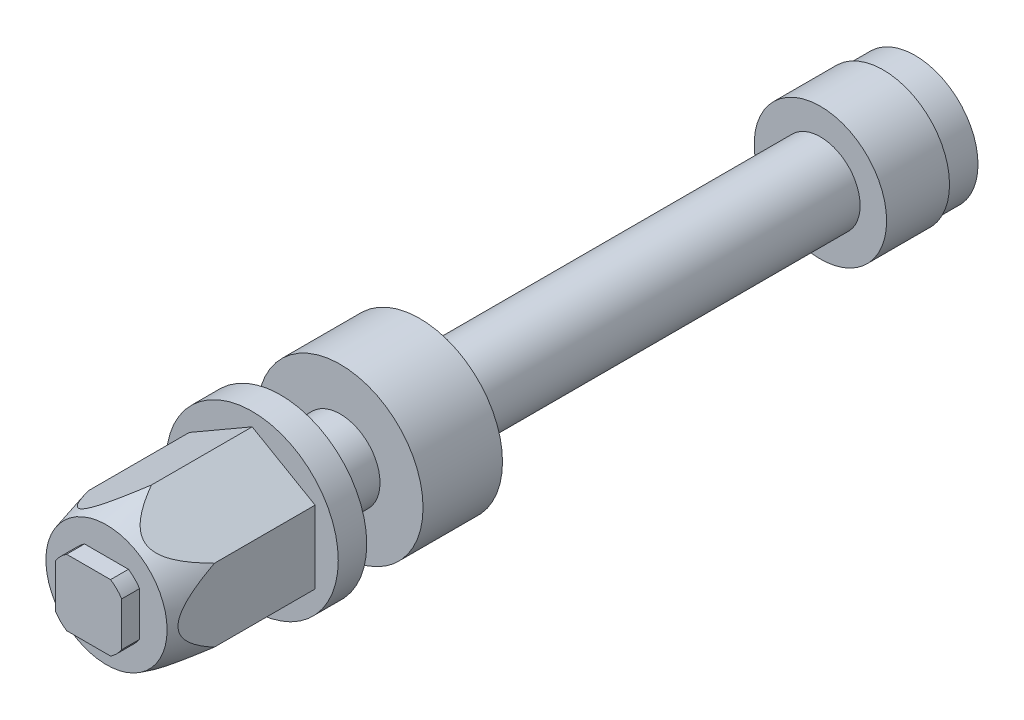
ISO-10303-21;
HEADER;
FILE_DESCRIPTION(('STEP AP214'),'2;1');
FILE_NAME('part.step','',(''),(''),'','','');
FILE_SCHEMA(('AUTOMOTIVE_DESIGN { 1 0 10303 214 1 1 1 1 }'));
ENDSEC;
DATA;
#1=APPLICATION_CONTEXT('core data for automotive mechanical design processes');
#2=APPLICATION_PROTOCOL_DEFINITION('international standard','automotive_design',2000,#1);
#3=PRODUCT_CONTEXT('',#1,'mechanical');
#4=PRODUCT('Part','Part','',(#3));
#5=PRODUCT_RELATED_PRODUCT_CATEGORY('part','',(#4));
#6=PRODUCT_DEFINITION_FORMATION('','',#4);
#7=PRODUCT_DEFINITION_CONTEXT('part definition',#1,'design');
#8=PRODUCT_DEFINITION('design','',#6,#7);
#9=PRODUCT_DEFINITION_SHAPE('','',#8);
#10=(LENGTH_UNIT() NAMED_UNIT(*) SI_UNIT(.MILLI.,.METRE.));
#11=(NAMED_UNIT(*) PLANE_ANGLE_UNIT() SI_UNIT($,.RADIAN.));
#12=(NAMED_UNIT(*) SI_UNIT($,.STERADIAN.) SOLID_ANGLE_UNIT());
#13=UNCERTAINTY_MEASURE_WITH_UNIT(LENGTH_MEASURE(1.E-05),#10,'distance_accuracy_value','');
#14=(GEOMETRIC_REPRESENTATION_CONTEXT(3) GLOBAL_UNCERTAINTY_ASSIGNED_CONTEXT((#13)) GLOBAL_UNIT_ASSIGNED_CONTEXT((#10,
#11,#12)) REPRESENTATION_CONTEXT('',''));
#15=CARTESIAN_POINT('',(0.,0.,0.));
#16=DIRECTION('',(0.,0.,1.));
#17=DIRECTION('',(1.,0.,0.));
#18=AXIS2_PLACEMENT_3D('',#15,#16,#17);
#19=CARTESIAN_POINT('',(-6.072,6.072,-98.));
#20=DIRECTION('',(0.,0.,-1.));
#21=DIRECTION('',(1.,0.,0.));
#22=AXIS2_PLACEMENT_3D('',#19,#20,#21);
#23=PLANE('',#22);
#24=CARTESIAN_POINT('',(0.,0.,-98.));
#25=DIRECTION('',(0.,0.,-1.));
#26=DIRECTION('',(1.,0.,0.));
#27=AXIS2_PLACEMENT_3D('',#24,#25,#26);
#28=CIRCLE('',#27,6.);
#29=CARTESIAN_POINT('',(6.,0.,-98.));
#30=VERTEX_POINT('',#29);
#31=EDGE_CURVE('E18',#30,#30,#28,.T.);
#32=ORIENTED_EDGE('',*,*,#31,.T.);
#33=EDGE_LOOP('',(#32));
#34=FACE_BOUND('',#33,.T.);
#35=ADVANCED_FACE('F14',(#34),#23,.T.);
#36=CARTESIAN_POINT('',(0.,0.,-95.8));
#37=DIRECTION('',(0.,0.,-1.));
#38=DIRECTION('',(1.,0.,0.));
#39=AXIS2_PLACEMENT_3D('',#36,#37,#38);
#40=CYLINDRICAL_SURFACE('',#39,6.);
#41=ORIENTED_EDGE('',*,*,#31,.F.);
#42=EDGE_LOOP('',(#41));
#43=FACE_BOUND('',#42,.T.);
#44=CARTESIAN_POINT('',(0.,0.,-95.8));
#45=DIRECTION('',(0.,0.,-1.));
#46=DIRECTION('',(1.,0.,0.));
#47=AXIS2_PLACEMENT_3D('',#44,#45,#46);
#48=CIRCLE('',#47,6.);
#49=CARTESIAN_POINT('',(6.,0.,-95.8));
#50=VERTEX_POINT('',#49);
#51=EDGE_CURVE('E337',#50,#50,#48,.F.);
#52=ORIENTED_EDGE('',*,*,#51,.F.);
#53=EDGE_LOOP('',(#52));
#54=FACE_BOUND('',#53,.T.);
#55=ADVANCED_FACE('F215',(#43,#54),#40,.T.);
#56=CARTESIAN_POINT('',(-9.614,9.614,-95.8));
#57=DIRECTION('',(0.,0.,-1.));
#58=DIRECTION('',(1.,0.,0.));
#59=AXIS2_PLACEMENT_3D('',#56,#57,#58);
#60=PLANE('',#59);
#61=ORIENTED_EDGE('',*,*,#51,.T.);
#62=EDGE_LOOP('',(#61));
#63=FACE_BOUND('',#62,.T.);
#64=CARTESIAN_POINT('',(0.,0.,-95.8));
#65=DIRECTION('',(0.,0.,-1.));
#66=DIRECTION('',(1.,0.,0.));
#67=AXIS2_PLACEMENT_3D('',#64,#65,#66);
#68=CIRCLE('',#67,9.5);
#69=CARTESIAN_POINT('',(9.5,0.,-95.8));
#70=VERTEX_POINT('',#69);
#71=EDGE_CURVE('E335',#70,#70,#68,.T.);
#72=ORIENTED_EDGE('',*,*,#71,.T.);
#73=EDGE_LOOP('',(#72));
#74=FACE_BOUND('',#73,.T.);
#75=ADVANCED_FACE('F217',(#63,#74),#60,.T.);
#76=CARTESIAN_POINT('',(0.,0.,-91.));
#77=DIRECTION('',(0.,0.,-1.));
#78=DIRECTION('',(1.,0.,0.));
#79=AXIS2_PLACEMENT_3D('',#76,#77,#78);
#80=CYLINDRICAL_SURFACE('',#79,9.5);
#81=ORIENTED_EDGE('',*,*,#71,.F.);
#82=EDGE_LOOP('',(#81));
#83=FACE_BOUND('',#82,.T.);
#84=CARTESIAN_POINT('',(0.,0.,-91.));
#85=DIRECTION('',(0.,0.,-1.));
#86=DIRECTION('',(1.,0.,0.));
#87=AXIS2_PLACEMENT_3D('',#84,#85,#86);
#88=CIRCLE('',#87,9.5);
#89=CARTESIAN_POINT('',(9.5,0.,-91.));
#90=VERTEX_POINT('',#89);
#91=EDGE_CURVE('E332',#90,#90,#88,.F.);
#92=ORIENTED_EDGE('',*,*,#91,.F.);
#93=EDGE_LOOP('',(#92));
#94=FACE_BOUND('',#93,.T.);
#95=ADVANCED_FACE('F220',(#83,#94),#80,.T.);
#96=CARTESIAN_POINT('',(-10.12,10.12,-91.));
#97=DIRECTION('',(0.,0.,-1.));
#98=DIRECTION('',(1.,0.,0.));
#99=AXIS2_PLACEMENT_3D('',#96,#97,#98);
#100=PLANE('',#99);
#101=ORIENTED_EDGE('',*,*,#91,.T.);
#102=EDGE_LOOP('',(#101));
#103=FACE_BOUND('',#102,.T.);
#104=CARTESIAN_POINT('',(0.,0.,-91.));
#105=DIRECTION('',(0.,0.,-1.));
#106=DIRECTION('',(1.,0.,0.));
#107=AXIS2_PLACEMENT_3D('',#104,#105,#106);
#108=CIRCLE('',#107,10.);
#109=CARTESIAN_POINT('',(10.,0.,-91.));
#110=VERTEX_POINT('',#109);
#111=EDGE_CURVE('E329',#110,#110,#108,.T.);
#112=ORIENTED_EDGE('',*,*,#111,.T.);
#113=EDGE_LOOP('',(#112));
#114=FACE_BOUND('',#113,.T.);
#115=ADVANCED_FACE('F222',(#103,#114),#100,.T.);
#116=CARTESIAN_POINT('',(0.,0.,-81.5));
#117=DIRECTION('',(0.,0.,-1.));
#118=DIRECTION('',(1.,0.,0.));
#119=AXIS2_PLACEMENT_3D('',#116,#117,#118);
#120=CYLINDRICAL_SURFACE('',#119,10.);
#121=ORIENTED_EDGE('',*,*,#111,.F.);
#122=EDGE_LOOP('',(#121));
#123=FACE_BOUND('',#122,.T.);
#124=CARTESIAN_POINT('',(0.,0.,-81.5));
#125=DIRECTION('',(0.,0.,-1.));
#126=DIRECTION('',(1.,0.,0.));
#127=AXIS2_PLACEMENT_3D('',#124,#125,#126);
#128=CIRCLE('',#127,10.);
#129=CARTESIAN_POINT('',(10.,0.,-81.5));
#130=VERTEX_POINT('',#129);
#131=EDGE_CURVE('E326',#130,#130,#128,.F.);
#132=ORIENTED_EDGE('',*,*,#131,.F.);
#133=EDGE_LOOP('',(#132));
#134=FACE_BOUND('',#133,.T.);
#135=ADVANCED_FACE('F225',(#123,#134),#120,.T.);
#136=CARTESIAN_POINT('',(10.12,10.12,-81.5));
#137=DIRECTION('',(0.,0.,1.));
#138=DIRECTION('',(-1.,0.,0.));
#139=AXIS2_PLACEMENT_3D('',#136,#137,#138);
#140=PLANE('',#139);
#141=CARTESIAN_POINT('',(0.,0.,-81.5));
#142=DIRECTION('',(0.,0.,-1.));
#143=DIRECTION('',(1.,0.,0.));
#144=AXIS2_PLACEMENT_3D('',#141,#142,#143);
#145=CIRCLE('',#144,6.);
#146=CARTESIAN_POINT('',(6.,0.,-81.5));
#147=VERTEX_POINT('',#146);
#148=EDGE_CURVE('E323',#147,#147,#145,.T.);
#149=ORIENTED_EDGE('',*,*,#148,.T.);
#150=EDGE_LOOP('',(#149));
#151=FACE_BOUND('',#150,.T.);
#152=ORIENTED_EDGE('',*,*,#131,.T.);
#153=EDGE_LOOP('',(#152));
#154=FACE_BOUND('',#153,.T.);
#155=ADVANCED_FACE('F227',(#151,#154),#140,.T.);
#156=CARTESIAN_POINT('',(0.,0.,-21.));
#157=DIRECTION('',(0.,0.,-1.));
#158=DIRECTION('',(1.,0.,0.));
#159=AXIS2_PLACEMENT_3D('',#156,#157,#158);
#160=CYLINDRICAL_SURFACE('',#159,6.);
#161=ORIENTED_EDGE('',*,*,#148,.F.);
#162=EDGE_LOOP('',(#161));
#163=FACE_BOUND('',#162,.T.);
#164=CARTESIAN_POINT('',(0.,0.,-21.));
#165=DIRECTION('',(0.,0.,-1.));
#166=DIRECTION('',(1.,0.,0.));
#167=AXIS2_PLACEMENT_3D('',#164,#165,#166);
#168=CIRCLE('',#167,6.);
#169=CARTESIAN_POINT('',(6.,0.,-21.));
#170=VERTEX_POINT('',#169);
#171=EDGE_CURVE('E320',#170,#170,#168,.F.);
#172=ORIENTED_EDGE('',*,*,#171,.F.);
#173=EDGE_LOOP('',(#172));
#174=FACE_BOUND('',#173,.T.);
#175=ADVANCED_FACE('F230',(#163,#174),#160,.T.);
#176=CARTESIAN_POINT('',(5.,5.,29.));
#177=DIRECTION('',(0.,0.,1.));
#178=DIRECTION('',(-1.,0.,0.));
#179=AXIS2_PLACEMENT_3D('',#176,#177,#178);
#180=PLANE('',#179);
#181=CARTESIAN_POINT('',(0.,0.,29.));
#182=DIRECTION('',(0.,0.,-1.));
#183=DIRECTION('',(1.,0.,0.));
#184=AXIS2_PLACEMENT_3D('',#181,#182,#183);
#185=CIRCLE('',#184,6.);
#186=CARTESIAN_POINT('',(-3.31662479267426,4.99999999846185,29.));
#187=VERTEX_POINT('',#186);
#188=CARTESIAN_POINT('',(-5.,3.3166247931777,29.));
#189=VERTEX_POINT('',#188);
#190=EDGE_CURVE('E116',#187,#189,#185,.F.);
#191=ORIENTED_EDGE('',*,*,#190,.T.);
#192=DIRECTION('',(0.,-1.,0.));
#193=VECTOR('',#192,1.);
#194=CARTESIAN_POINT('',(-5.,-5.00004168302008E-10,29.));
#195=LINE('',#194,#193);
#196=CARTESIAN_POINT('',(-4.99999999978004,-3.31662479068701,29.));
#197=VERTEX_POINT('',#196);
#198=EDGE_CURVE('E120',#189,#197,#195,.T.);
#199=ORIENTED_EDGE('',*,*,#198,.T.);
#200=CARTESIAN_POINT('',(0.,0.,29.));
#201=DIRECTION('',(0.,0.,-1.));
#202=DIRECTION('',(1.,0.,0.));
#203=AXIS2_PLACEMENT_3D('',#200,#201,#202);
#204=CIRCLE('',#203,6.);
#205=CARTESIAN_POINT('',(-3.31662479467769,-5.,29.));
#206=VERTEX_POINT('',#205);
#207=EDGE_CURVE('E139',#197,#206,#204,.F.);
#208=ORIENTED_EDGE('',*,*,#207,.T.);
#209=DIRECTION('',(1.,0.,0.));
#210=VECTOR('',#209,1.);
#211=CARTESIAN_POINT('',(-9.99995825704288E-10,-5.,29.));
#212=LINE('',#211,#210);
#213=CARTESIAN_POINT('',(3.31662479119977,-4.99999999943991,29.));
#214=VERTEX_POINT('',#213);
#215=EDGE_CURVE('E142',#206,#214,#212,.T.);
#216=ORIENTED_EDGE('',*,*,#215,.T.);
#217=CARTESIAN_POINT('',(0.,0.,29.));
#218=DIRECTION('',(0.,0.,-1.));
#219=DIRECTION('',(1.,0.,0.));
#220=AXIS2_PLACEMENT_3D('',#217,#218,#219);
#221=CIRCLE('',#220,6.);
#222=CARTESIAN_POINT('',(5.,-3.31662479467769,29.));
#223=VERTEX_POINT('',#222);
#224=EDGE_CURVE('E314',#214,#223,#221,.F.);
#225=ORIENTED_EDGE('',*,*,#224,.T.);
#226=DIRECTION('',(0.,1.,0.));
#227=VECTOR('',#226,1.);
#228=CARTESIAN_POINT('',(5.,-1.49999604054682E-09,29.));
#229=LINE('',#228,#227);
#230=CARTESIAN_POINT('',(5.00000000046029,3.3166247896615,29.));
#231=VERTEX_POINT('',#230);
#232=EDGE_CURVE('E592',#223,#231,#229,.T.);
#233=ORIENTED_EDGE('',*,*,#232,.T.);
#234=CARTESIAN_POINT('',(0.,0.,29.));
#235=DIRECTION('',(0.,0.,-1.));
#236=DIRECTION('',(1.,0.,0.));
#237=AXIS2_PLACEMENT_3D('',#234,#235,#236);
#238=CIRCLE('',#237,6.);
#239=CARTESIAN_POINT('',(3.3166247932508,4.99999999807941,29.));
#240=VERTEX_POINT('',#239);
#241=EDGE_CURVE('E311',#231,#240,#238,.F.);
#242=ORIENTED_EDGE('',*,*,#241,.T.);
#243=DIRECTION('',(-1.,0.,0.));
#244=VECTOR('',#243,1.);
#245=CARTESIAN_POINT('',(0.,5.,29.));
#246=LINE('',#245,#244);
#247=EDGE_CURVE('E113',#240,#187,#246,.T.);
#248=ORIENTED_EDGE('',*,*,#247,.T.);
#249=EDGE_LOOP('',(#191,#199,#208,#216,#225,#233,#242,#248));
#250=FACE_BOUND('',#249,.T.);
#251=ADVANCED_FACE('F118',(#250),#180,.T.);
#252=CARTESIAN_POINT('',(-12.65,12.65,-21.));
#253=DIRECTION('',(0.,0.,-1.));
#254=DIRECTION('',(1.,0.,0.));
#255=AXIS2_PLACEMENT_3D('',#252,#253,#254);
#256=PLANE('',#255);
#257=ORIENTED_EDGE('',*,*,#171,.T.);
#258=EDGE_LOOP('',(#257));
#259=FACE_BOUND('',#258,.T.);
#260=CARTESIAN_POINT('',(0.,0.,-21.));
#261=DIRECTION('',(0.,0.,-1.));
#262=DIRECTION('',(1.,0.,0.));
#263=AXIS2_PLACEMENT_3D('',#260,#261,#262);
#264=CIRCLE('',#263,12.5);
#265=CARTESIAN_POINT('',(12.5,0.,-21.));
#266=VERTEX_POINT('',#265);
#267=EDGE_CURVE('E307',#266,#266,#264,.T.);
#268=ORIENTED_EDGE('',*,*,#267,.T.);
#269=EDGE_LOOP('',(#268));
#270=FACE_BOUND('',#269,.T.);
#271=ADVANCED_FACE('F234',(#259,#270),#256,.T.);
#272=CARTESIAN_POINT('',(-3.31662479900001,5.,26.3));
#273=DIRECTION('',(0.,-1.,0.));
#274=DIRECTION('',(1.,0.,0.));
#275=AXIS2_PLACEMENT_3D('',#272,#273,#274);
#276=PLANE('',#275);
#277=DIRECTION('',(0.,0.,1.));
#278=VECTOR('',#277,1.);
#279=CARTESIAN_POINT('',(3.31662479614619,4.99999999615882,27.65));
#280=LINE('',#279,#278);
#281=CARTESIAN_POINT('',(3.31662479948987,4.99999999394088,26.3));
#282=VERTEX_POINT('',#281);
#283=EDGE_CURVE('E310',#240,#282,#280,.F.);
#284=ORIENTED_EDGE('',*,*,#283,.T.);
#285=DIRECTION('',(-1.,0.,0.));
#286=VECTOR('',#285,1.);
#287=CARTESIAN_POINT('',(0.,4.99999999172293,26.3));
#288=LINE('',#287,#286);
#289=CARTESIAN_POINT('',(-3.31662479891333,4.99999999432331,26.3));
#290=VERTEX_POINT('',#289);
#291=EDGE_CURVE('E306',#282,#290,#288,.T.);
#292=ORIENTED_EDGE('',*,*,#291,.T.);
#293=DIRECTION('',(0.,0.,-1.));
#294=VECTOR('',#293,1.);
#295=CARTESIAN_POINT('',(-3.3166247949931,4.9999999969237,27.65));
#296=LINE('',#295,#294);
#297=EDGE_CURVE('E125',#290,#187,#296,.F.);
#298=ORIENTED_EDGE('',*,*,#297,.T.);
#299=ORIENTED_EDGE('',*,*,#247,.F.);
#300=EDGE_LOOP('',(#284,#292,#298,#299));
#301=FACE_BOUND('',#300,.T.);
#302=ADVANCED_FACE('F237',(#301),#276,.F.);
#303=CARTESIAN_POINT('',(0.,0.,29.));
#304=DIRECTION('',(0.,0.,-1.));
#305=DIRECTION('',(1.,0.,0.));
#306=AXIS2_PLACEMENT_3D('',#303,#304,#305);
#307=CYLINDRICAL_SURFACE('',#306,6.);
#308=ORIENTED_EDGE('',*,*,#190,.F.);
#309=ORIENTED_EDGE('',*,*,#297,.F.);
#310=CARTESIAN_POINT('',(0.,0.,26.3));
#311=DIRECTION('',(0.,0.,-1.));
#312=DIRECTION('',(1.,0.,0.));
#313=AXIS2_PLACEMENT_3D('',#310,#311,#312);
#314=CIRCLE('',#313,6.);
#315=CARTESIAN_POINT('',(-4.99999999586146,3.31662479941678,26.3));
#316=VERTEX_POINT('',#315);
#317=EDGE_CURVE('E130',#290,#316,#314,.F.);
#318=ORIENTED_EDGE('',*,*,#317,.T.);
#319=DIRECTION('',(0.,0.,1.));
#320=VECTOR('',#319,1.);
#321=CARTESIAN_POINT('',(-5.,3.316624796,27.65));
#322=LINE('',#321,#320);
#323=EDGE_CURVE('E124',#316,#189,#322,.T.);
#324=ORIENTED_EDGE('',*,*,#323,.T.);
#325=EDGE_LOOP('',(#308,#309,#318,#324));
#326=FACE_BOUND('',#325,.T.);
#327=ADVANCED_FACE('F128',(#326),#307,.T.);
#328=CARTESIAN_POINT('',(-5.,-3.31662479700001,26.3));
#329=DIRECTION('',(1.,0.,0.));
#330=DIRECTION('',(0.,1.,0.));
#331=AXIS2_PLACEMENT_3D('',#328,#329,#330);
#332=PLANE('',#331);
#333=ORIENTED_EDGE('',*,*,#323,.F.);
#334=DIRECTION('',(0.,-1.,0.));
#335=VECTOR('',#334,1.);
#336=CARTESIAN_POINT('',(-4.99999999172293,0.,26.3));
#337=LINE('',#336,#335);
#338=CARTESIAN_POINT('',(-4.9999999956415,-3.31662479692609,26.3));
#339=VERTEX_POINT('',#338);
#340=EDGE_CURVE('E304',#316,#339,#337,.T.);
#341=ORIENTED_EDGE('',*,*,#340,.T.);
#342=DIRECTION('',(0.,0.,-1.));
#343=VECTOR('',#342,1.);
#344=CARTESIAN_POINT('',(-4.99999999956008,-3.31662479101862,27.65));
#345=LINE('',#344,#343);
#346=EDGE_CURVE('E136',#339,#197,#345,.F.);
#347=ORIENTED_EDGE('',*,*,#346,.T.);
#348=ORIENTED_EDGE('',*,*,#198,.F.);
#349=EDGE_LOOP('',(#333,#341,#347,#348));
#350=FACE_BOUND('',#349,.T.);
#351=ADVANCED_FACE('F134',(#350),#332,.F.);
#352=CARTESIAN_POINT('',(0.,0.,29.));
#353=DIRECTION('',(0.,0.,-1.));
#354=DIRECTION('',(1.,0.,0.));
#355=AXIS2_PLACEMENT_3D('',#352,#353,#354);
#356=CYLINDRICAL_SURFACE('',#355,6.);
#357=ORIENTED_EDGE('',*,*,#207,.F.);
#358=ORIENTED_EDGE('',*,*,#346,.F.);
#359=CARTESIAN_POINT('',(0.,0.,26.3));
#360=DIRECTION('',(0.,0.,-1.));
#361=DIRECTION('',(1.,0.,0.));
#362=AXIS2_PLACEMENT_3D('',#359,#360,#361);
#363=CIRCLE('',#362,6.);
#364=CARTESIAN_POINT('',(-3.31662480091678,-4.99999999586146,26.3));
#365=VERTEX_POINT('',#364);
#366=EDGE_CURVE('E302',#339,#365,#363,.F.);
#367=ORIENTED_EDGE('',*,*,#366,.T.);
#368=DIRECTION('',(0.,0.,1.));
#369=VECTOR('',#368,1.);
#370=CARTESIAN_POINT('',(-3.316624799,-5.,27.65));
#371=LINE('',#370,#369);
#372=EDGE_CURVE('E318',#365,#206,#371,.T.);
#373=ORIENTED_EDGE('',*,*,#372,.T.);
#374=EDGE_LOOP('',(#357,#358,#367,#373));
#375=FACE_BOUND('',#374,.T.);
#376=ADVANCED_FACE('F244',(#375),#356,.T.);
#377=CARTESIAN_POINT('',(3.31662479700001,-5.,26.3));
#378=DIRECTION('',(0.,1.,0.));
#379=DIRECTION('',(-1.,0.,0.));
#380=AXIS2_PLACEMENT_3D('',#377,#378,#379);
#381=PLANE('',#380);
#382=ORIENTED_EDGE('',*,*,#372,.F.);
#383=DIRECTION('',(1.,0.,0.));
#384=VECTOR('',#383,1.);
#385=CARTESIAN_POINT('',(0.,-4.99999999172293,26.3));
#386=LINE('',#385,#384);
#387=CARTESIAN_POINT('',(3.31662479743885,-4.99999999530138,26.3));
#388=VERTEX_POINT('',#387);
#389=EDGE_CURVE('E301',#365,#388,#386,.T.);
#390=ORIENTED_EDGE('',*,*,#389,.T.);
#391=DIRECTION('',(0.,0.,-1.));
#392=VECTOR('',#391,1.);
#393=CARTESIAN_POINT('',(3.31662479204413,-4.99999999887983,27.65));
#394=LINE('',#393,#392);
#395=EDGE_CURVE('E317',#388,#214,#394,.F.);
#396=ORIENTED_EDGE('',*,*,#395,.T.);
#397=ORIENTED_EDGE('',*,*,#215,.F.);
#398=EDGE_LOOP('',(#382,#390,#396,#397));
#399=FACE_BOUND('',#398,.T.);
#400=ADVANCED_FACE('F245',(#399),#381,.F.);
#401=CARTESIAN_POINT('',(0.,0.,29.));
#402=DIRECTION('',(0.,0.,-1.));
#403=DIRECTION('',(1.,0.,0.));
#404=AXIS2_PLACEMENT_3D('',#401,#402,#403);
#405=CYLINDRICAL_SURFACE('',#404,6.);
#406=ORIENTED_EDGE('',*,*,#224,.F.);
#407=ORIENTED_EDGE('',*,*,#395,.F.);
#408=CARTESIAN_POINT('',(0.,0.,26.3));
#409=DIRECTION('',(0.,0.,-1.));
#410=DIRECTION('',(1.,0.,0.));
#411=AXIS2_PLACEMENT_3D('',#408,#409,#410);
#412=CIRCLE('',#411,6.);
#413=CARTESIAN_POINT('',(4.99999999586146,-3.31662480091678,26.3));
#414=VERTEX_POINT('',#413);
#415=EDGE_CURVE('E299',#388,#414,#412,.F.);
#416=ORIENTED_EDGE('',*,*,#415,.T.);
#417=DIRECTION('',(0.,0.,1.));
#418=VECTOR('',#417,1.);
#419=CARTESIAN_POINT('',(5.,-3.316624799,27.65));
#420=LINE('',#419,#418);
#421=EDGE_CURVE('E316',#414,#223,#420,.T.);
#422=ORIENTED_EDGE('',*,*,#421,.T.);
#423=EDGE_LOOP('',(#406,#407,#416,#422));
#424=FACE_BOUND('',#423,.T.);
#425=ADVANCED_FACE('F248',(#424),#405,.T.);
#426=CARTESIAN_POINT('',(5.,3.31662479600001,26.3));
#427=DIRECTION('',(-1.,0.,0.));
#428=DIRECTION('',(0.,-1.,0.));
#429=AXIS2_PLACEMENT_3D('',#426,#427,#428);
#430=PLANE('',#429);
#431=ORIENTED_EDGE('',*,*,#421,.F.);
#432=DIRECTION('',(0.,1.,0.));
#433=VECTOR('',#432,1.);
#434=CARTESIAN_POINT('',(4.99999999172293,0.,26.3));
#435=LINE('',#434,#433);
#436=CARTESIAN_POINT('',(4.99999999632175,3.31662479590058,26.3));
#437=VERTEX_POINT('',#436);
#438=EDGE_CURVE('E298',#414,#437,#435,.T.);
#439=ORIENTED_EDGE('',*,*,#438,.T.);
#440=DIRECTION('',(0.,0.,-1.));
#441=VECTOR('',#440,1.);
#442=CARTESIAN_POINT('',(5.00000000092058,3.31662478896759,27.65));
#443=LINE('',#442,#441);
#444=EDGE_CURVE('E313',#437,#231,#443,.F.);
#445=ORIENTED_EDGE('',*,*,#444,.T.);
#446=ORIENTED_EDGE('',*,*,#232,.F.);
#447=EDGE_LOOP('',(#431,#439,#445,#446));
#448=FACE_BOUND('',#447,.T.);
#449=ADVANCED_FACE('F250',(#448),#430,.F.);
#450=CARTESIAN_POINT('',(0.,0.,29.));
#451=DIRECTION('',(0.,0.,-1.));
#452=DIRECTION('',(1.,0.,0.));
#453=AXIS2_PLACEMENT_3D('',#450,#451,#452);
#454=CYLINDRICAL_SURFACE('',#453,6.);
#455=ORIENTED_EDGE('',*,*,#241,.F.);
#456=ORIENTED_EDGE('',*,*,#444,.F.);
#457=CARTESIAN_POINT('',(0.,0.,26.3));
#458=DIRECTION('',(0.,0.,-1.));
#459=DIRECTION('',(1.,0.,0.));
#460=AXIS2_PLACEMENT_3D('',#457,#458,#459);
#461=CIRCLE('',#460,6.);
#462=EDGE_CURVE('E295',#437,#282,#461,.F.);
#463=ORIENTED_EDGE('',*,*,#462,.T.);
#464=ORIENTED_EDGE('',*,*,#283,.F.);
#465=EDGE_LOOP('',(#455,#456,#463,#464));
#466=FACE_BOUND('',#465,.T.);
#467=ADVANCED_FACE('F253',(#466),#454,.T.);
#468=CARTESIAN_POINT('',(0.,0.,-9.));
#469=DIRECTION('',(0.,0.,-1.));
#470=DIRECTION('',(1.,0.,0.));
#471=AXIS2_PLACEMENT_3D('',#468,#469,#470);
#472=CYLINDRICAL_SURFACE('',#471,12.5);
#473=ORIENTED_EDGE('',*,*,#267,.F.);
#474=EDGE_LOOP('',(#473));
#475=FACE_BOUND('',#474,.T.);
#476=CARTESIAN_POINT('',(0.,0.,-9.));
#477=DIRECTION('',(0.,0.,-1.));
#478=DIRECTION('',(1.,0.,0.));
#479=AXIS2_PLACEMENT_3D('',#476,#477,#478);
#480=CIRCLE('',#479,12.5);
#481=CARTESIAN_POINT('',(12.5,0.,-9.));
#482=VERTEX_POINT('',#481);
#483=EDGE_CURVE('E292',#482,#482,#480,.F.);
#484=ORIENTED_EDGE('',*,*,#483,.F.);
#485=EDGE_LOOP('',(#484));
#486=FACE_BOUND('',#485,.T.);
#487=ADVANCED_FACE('F259',(#475,#486),#472,.T.);
#488=CARTESIAN_POINT('',(9.26080236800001,-9.26080236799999,26.3));
#489=DIRECTION('',(0.,0.,-1.));
#490=DIRECTION('',(-1.,0.,0.));
#491=AXIS2_PLACEMENT_3D('',#488,#489,#490);
#492=PLANE('',#491);
#493=ORIENTED_EDGE('',*,*,#438,.F.);
#494=ORIENTED_EDGE('',*,*,#415,.F.);
#495=ORIENTED_EDGE('',*,*,#389,.F.);
#496=ORIENTED_EDGE('',*,*,#366,.F.);
#497=ORIENTED_EDGE('',*,*,#340,.F.);
#498=ORIENTED_EDGE('',*,*,#317,.F.);
#499=ORIENTED_EDGE('',*,*,#291,.F.);
#500=ORIENTED_EDGE('',*,*,#462,.F.);
#501=EDGE_LOOP('',(#493,#494,#495,#496,#497,#498,#499,#500));
#502=FACE_BOUND('',#501,.T.);
#503=CARTESIAN_POINT('',(0.,0.,26.3));
#504=DIRECTION('',(0.,0.,-1.));
#505=DIRECTION('',(1.,0.,0.));
#506=AXIS2_PLACEMENT_3D('',#503,#504,#505);
#507=CIRCLE('',#506,9.150990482);
#508=CARTESIAN_POINT('',(9.150990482,0.,26.3));
#509=VERTEX_POINT('',#508);
#510=EDGE_CURVE('E289',#509,#509,#507,.F.);
#511=ORIENTED_EDGE('',*,*,#510,.T.);
#512=EDGE_LOOP('',(#511));
#513=FACE_BOUND('',#512,.T.);
#514=ADVANCED_FACE('F255',(#502,#513),#492,.F.);
#515=CARTESIAN_POINT('',(12.65,12.65,-9.));
#516=DIRECTION('',(0.,0.,1.));
#517=DIRECTION('',(-1.,0.,0.));
#518=AXIS2_PLACEMENT_3D('',#515,#516,#517);
#519=PLANE('',#518);
#520=CARTESIAN_POINT('',(0.,0.,-9.));
#521=DIRECTION('',(0.,0.,-1.));
#522=DIRECTION('',(1.,0.,0.));
#523=AXIS2_PLACEMENT_3D('',#520,#521,#522);
#524=CIRCLE('',#523,6.);
#525=CARTESIAN_POINT('',(6.,0.,-9.));
#526=VERTEX_POINT('',#525);
#527=EDGE_CURVE('E281',#526,#526,#524,.T.);
#528=ORIENTED_EDGE('',*,*,#527,.T.);
#529=EDGE_LOOP('',(#528));
#530=FACE_BOUND('',#529,.T.);
#531=ORIENTED_EDGE('',*,*,#483,.T.);
#532=EDGE_LOOP('',(#531));
#533=FACE_BOUND('',#532,.T.);
#534=ADVANCED_FACE('F258',(#530,#533),#519,.T.);
#535=CARTESIAN_POINT('',(0.,0.,26.3));
#536=DIRECTION('',(0.,0.,-1.));
#537=DIRECTION('',(1.,0.,0.));
#538=AXIS2_PLACEMENT_3D('',#535,#536,#537);
#539=CONICAL_SURFACE('',#538,9.150990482,0.261799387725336);
#540=ORIENTED_EDGE('',*,*,#510,.F.);
#541=EDGE_LOOP('',(#540));
#542=FACE_BOUND('',#541,.T.);
#543=CARTESIAN_POINT('',(6.10256282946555E-09,-10.9696551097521,19.5126511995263));
#544=CARTESIAN_POINT('',(0.0634488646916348,-10.9330228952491,19.6493562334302));
#545=CARTESIAN_POINT('',(0.127631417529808,-10.8959670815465,19.78560607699));
#546=CARTESIAN_POINT('',(0.257633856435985,-10.8209101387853,20.0570747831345));
#547=CARTESIAN_POINT('',(0.32345388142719,-10.7829089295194,20.192293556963));
#548=CARTESIAN_POINT('',(0.523848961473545,-10.6672107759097,20.5966722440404));
#549=CARTESIAN_POINT('',(0.661131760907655,-10.587950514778,20.8640613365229));
#550=CARTESIAN_POINT('',(0.946289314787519,-10.4233147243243,21.3956178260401));
#551=CARTESIAN_POINT('',(1.09427022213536,-10.3378779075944,21.6597096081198));
#552=CARTESIAN_POINT('',(1.40172472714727,-10.1603689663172,22.178663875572));
#553=CARTESIAN_POINT('',(1.56118902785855,-10.0683022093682,22.4335335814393));
#554=CARTESIAN_POINT('',(1.80700454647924,-9.92638055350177,22.7987192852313));
#555=CARTESIAN_POINT('',(1.88749663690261,-9.87990842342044,22.9142972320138));
#556=CARTESIAN_POINT('',(2.0523607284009,-9.784724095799,23.1417441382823));
#557=CARTESIAN_POINT('',(2.13673317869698,-9.73601163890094,23.2536126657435));
#558=CARTESIAN_POINT('',(2.30985609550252,-9.63605907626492,23.4726406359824));
#559=CARTESIAN_POINT('',(2.39860372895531,-9.584820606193,23.5798030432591));
#560=CARTESIAN_POINT('',(2.58115638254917,-9.47942378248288,23.7881875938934));
#561=CARTESIAN_POINT('',(2.67496035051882,-9.42526603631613,23.8894109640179));
#562=CARTESIAN_POINT('',(2.9233183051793,-9.28187650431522,24.1396866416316));
#563=CARTESIAN_POINT('',(3.08212147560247,-9.19019145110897,24.2832583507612));
#564=CARTESIAN_POINT('',(3.41643833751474,-8.99717352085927,24.5416779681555));
#565=CARTESIAN_POINT('',(3.59190139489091,-8.89586987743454,24.6566092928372));
#566=CARTESIAN_POINT('',(3.89869957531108,-8.71873986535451,24.8120548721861));
#567=CARTESIAN_POINT('',(4.02538741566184,-8.64559660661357,24.8646084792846));
#568=CARTESIAN_POINT('',(4.28450978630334,-8.49599223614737,24.9451218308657));
#569=CARTESIAN_POINT('',(4.41693645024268,-8.41953566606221,24.9731141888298));
#570=CARTESIAN_POINT('',(4.68483156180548,-8.26486635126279,25.0010793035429));
#571=CARTESIAN_POINT('',(4.8203130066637,-8.18664610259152,25.0008921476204));
#572=CARTESIAN_POINT('',(5.08898080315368,-8.03153067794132,24.9721319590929));
#573=CARTESIAN_POINT('',(5.22216570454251,-7.95463633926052,24.9435416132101));
#574=CARTESIAN_POINT('',(5.5100403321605,-7.78843184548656,24.8529690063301));
#575=CARTESIAN_POINT('',(5.66333734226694,-7.69992577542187,24.7852134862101));
#576=CARTESIAN_POINT('',(5.95867005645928,-7.52941535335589,24.6225226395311));
#577=CARTESIAN_POINT('',(6.10067910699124,-7.44742638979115,24.5275252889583));
#578=CARTESIAN_POINT('',(6.35825831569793,-7.29871296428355,24.3300827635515));
#579=CARTESIAN_POINT('',(6.47501165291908,-7.23130539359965,24.2296450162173));
#580=CARTESIAN_POINT('',(6.7007215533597,-7.10099172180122,24.0175948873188));
#581=CARTESIAN_POINT('',(6.8096710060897,-7.0380897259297,23.9059725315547));
#582=CARTESIAN_POINT('',(7.02146523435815,-6.91581027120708,23.6736789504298));
#583=CARTESIAN_POINT('',(7.12426171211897,-6.85646069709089,23.5529496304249));
#584=CARTESIAN_POINT('',(7.32388119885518,-6.74121033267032,23.3052143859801));
#585=CARTESIAN_POINT('',(7.4207065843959,-6.6853081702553,23.1782109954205));
#586=CARTESIAN_POINT('',(7.6148771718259,-6.57320372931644,22.9116471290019));
#587=CARTESIAN_POINT('',(7.71191369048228,-6.51717966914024,22.771788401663));
#588=CARTESIAN_POINT('',(7.90115733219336,-6.40791980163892,22.4877653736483));
#589=CARTESIAN_POINT('',(7.99336354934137,-6.35468451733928,22.3436002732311));
#590=CARTESIAN_POINT('',(8.26401505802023,-6.19842379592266,21.9056561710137));
#591=CARTESIAN_POINT('',(8.43625499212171,-6.09898102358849,21.6067650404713));
#592=CARTESIAN_POINT('',(8.76209449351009,-5.91085749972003,21.0112743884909));
#593=CARTESIAN_POINT('',(8.91614852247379,-5.82191436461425,20.7150011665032));
#594=CARTESIAN_POINT('',(9.14015466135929,-5.69258436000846,20.2665652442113));
#595=CARTESIAN_POINT('',(9.2135296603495,-5.65022128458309,20.1166646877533));
#596=CARTESIAN_POINT('',(9.3582370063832,-5.56667445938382,19.8155785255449));
#597=CARTESIAN_POINT('',(9.42956961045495,-5.52549056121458,19.6643930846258));
#598=CARTESIAN_POINT('',(9.49999999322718,-5.48482756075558,19.5126512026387));
#599=B_SPLINE_CURVE_WITH_KNOTS('',3,(#543,#544,#545,#546,#547,#548,#549,#550,#551,#552,#553,
#554,#555,#556,#557,#558,#559,#560,#561,#562,#563,#564,#565,#566,#567,#568,#569,#570,#571,#572,
#573,#574,#575,#576,#577,#578,#579,#580,#581,#582,#583,#584,#585,#586,#587,#588,#589,#590,#591,
#592,#593,#594,#595,#596,#597,#598),.UNSPECIFIED.,.F.,.F.,(4,2,2,2,2,2,2,2,2,2,2,2,2,2,2,2,2,2,
2,2,2,2,2,2,2,2,2,4),(0.,0.465292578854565,0.930624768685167,1.86296450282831,2.80634177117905,
3.74896368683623,4.19381456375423,4.63871707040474,5.08333517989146,5.52786112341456,
6.22481389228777,6.91971238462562,7.38431302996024,7.8482958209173,8.3149117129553,
8.78181220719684,9.34723824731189,9.91396200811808,10.4175759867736,10.9216431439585,
11.4292537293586,11.9366609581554,12.4741121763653,13.0116638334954,14.0880685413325,
15.1245428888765,15.6410886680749,16.1575691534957),.UNSPECIFIED.);
#600=CARTESIAN_POINT('',(0.,-10.9696551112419,19.5126511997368));
#601=VERTEX_POINT('',#600);
#602=CARTESIAN_POINT('',(9.49999999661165,-5.48482755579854,19.5126512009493));
#603=VERTEX_POINT('',#602);
#604=EDGE_CURVE('E280',#601,#603,#599,.T.);
#605=ORIENTED_EDGE('',*,*,#604,.T.);
#606=CARTESIAN_POINT('',(9.49999999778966,-5.48482755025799,19.5126511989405));
#607=CARTESIAN_POINT('',(9.49999999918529,-5.41128480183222,19.6498754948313));
#608=CARTESIAN_POINT('',(9.49999999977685,-5.33688846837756,19.7866411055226));
#609=CARTESIAN_POINT('',(9.50000000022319,-5.18619002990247,20.0591330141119));
#610=CARTESIAN_POINT('',(9.50000000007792,-5.10988776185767,20.194859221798));
#611=CARTESIAN_POINT('',(9.4999999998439,-4.87756577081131,20.6007453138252));
#612=CARTESIAN_POINT('',(9.49999999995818,-4.71839330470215,20.8691194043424));
#613=CARTESIAN_POINT('',(9.50000000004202,-4.38896415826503,21.4005762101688));
#614=CARTESIAN_POINT('',(9.50000000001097,-4.21866341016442,21.6636317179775));
#615=CARTESIAN_POINT('',(9.49999999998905,-3.86487531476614,22.1805721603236));
#616=CARTESIAN_POINT('',(9.49999999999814,-3.68139851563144,22.4344641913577));
#617=CARTESIAN_POINT('',(9.50000000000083,-3.40393890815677,22.7914366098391));
#618=CARTESIAN_POINT('',(9.50000000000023,-3.31688903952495,22.8999128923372));
#619=CARTESIAN_POINT('',(9.49999999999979,-3.13888608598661,23.113639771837));
#620=CARTESIAN_POINT('',(9.49999999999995,-3.04793278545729,23.2188901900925));
#621=CARTESIAN_POINT('',(9.50000000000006,-2.86131580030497,23.425734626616));
#622=CARTESIAN_POINT('',(9.50000000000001,-2.76563859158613,23.5273165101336));
#623=CARTESIAN_POINT('',(9.5,-2.5692361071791,23.7254664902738));
#624=CARTESIAN_POINT('',(9.50000000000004,-2.46851150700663,23.8220352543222));
#625=CARTESIAN_POINT('',(9.49999999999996,-2.25954611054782,24.0104173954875));
#626=CARTESIAN_POINT('',(9.49999999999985,-2.15120799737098,24.1021246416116));
#627=CARTESIAN_POINT('',(9.50000000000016,-1.92793405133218,24.27705546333));
#628=CARTESIAN_POINT('',(9.50000000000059,-1.81299577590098,24.360275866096));
#629=CARTESIAN_POINT('',(9.49999999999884,-1.45836098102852,24.5925819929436));
#630=CARTESIAN_POINT('',(9.49999999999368,-1.20721115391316,24.7258820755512));
#631=CARTESIAN_POINT('',(9.5000000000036,-0.791928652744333,24.8789033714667));
#632=CARTESIAN_POINT('',(9.50000000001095,-0.636775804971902,24.9228166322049));
#633=CARTESIAN_POINT('',(9.49999999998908,-0.321082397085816,24.9820894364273));
#634=CARTESIAN_POINT('',(9.49999999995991,-0.160549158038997,24.9974862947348));
#635=CARTESIAN_POINT('',(9.49999999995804,0.169756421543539,24.9974707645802));
#636=CARTESIAN_POINT('',(9.49999999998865,0.339530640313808,24.9802408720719));
#637=CARTESIAN_POINT('',(9.50000000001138,0.672828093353,24.9141336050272));
#638=CARTESIAN_POINT('',(9.50000000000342,0.836339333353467,24.865198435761));
#639=CARTESIAN_POINT('',(9.49999999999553,1.20174866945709,24.7232046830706));
#640=CARTESIAN_POINT('',(9.4999999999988,1.40009749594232,24.6212298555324));
#641=CARTESIAN_POINT('',(9.50000000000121,1.7787695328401,24.3881273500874));
#642=CARTESIAN_POINT('',(9.50000000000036,1.95903926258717,24.2569166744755));
#643=CARTESIAN_POINT('',(9.49999999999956,2.34427513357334,23.9421996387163));
#644=CARTESIAN_POINT('',(9.49999999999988,2.54504935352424,23.7536562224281));
#645=CARTESIAN_POINT('',(9.50000000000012,2.92786371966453,23.3581956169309));
#646=CARTESIAN_POINT('',(9.50000000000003,3.10986608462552,23.1512428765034));
#647=CARTESIAN_POINT('',(9.49999999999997,3.46019665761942,22.7240031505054));
#648=CARTESIAN_POINT('',(9.49999999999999,3.62843064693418,22.5036398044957));
#649=CARTESIAN_POINT('',(9.50000000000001,3.95301175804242,22.0546847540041));
#650=CARTESIAN_POINT('',(9.5,4.10936844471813,21.8260998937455));
#651=CARTESIAN_POINT('',(9.5,4.37214622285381,21.4247328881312));
#652=CARTESIAN_POINT('',(9.5,4.48074507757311,21.2533638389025));
#653=CARTESIAN_POINT('',(9.5,4.6936133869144,20.9079259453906));
#654=CARTESIAN_POINT('',(9.5,4.79788220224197,20.733856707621));
#655=CARTESIAN_POINT('',(9.5,5.00107097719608,20.3862317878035));
#656=CARTESIAN_POINT('',(9.5,5.10004869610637,20.2127097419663));
#657=CARTESIAN_POINT('',(9.5,5.29475670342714,19.863920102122));
#658=CARTESIAN_POINT('',(9.5,5.39048796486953,19.6886530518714));
#659=CARTESIAN_POINT('',(9.5,5.48482754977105,19.5126512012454));
#660=B_SPLINE_CURVE_WITH_KNOTS('',3,(#606,#607,#608,#609,#610,#611,#612,#613,#614,#615,#616,
#617,#618,#619,#620,#621,#622,#623,#624,#625,#626,#627,#628,#629,#630,#631,#632,#633,#634,#635,
#636,#637,#638,#639,#640,#641,#642,#643,#644,#645,#646,#647,#648,#649,#650,#651,#652,#653,#654,
#655,#656,#657,#658,#659),.UNSPECIFIED.,.F.,.F.,(4,2,2,2,2,2,2,2,2,2,2,2,2,2,2,2,2,2,2,2,2,2,2,
2,2,2,4),(0.,0.467059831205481,0.934159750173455,1.87003517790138,2.80987220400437,
3.74896505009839,4.1661493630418,4.58335675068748,5.00183697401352,5.42026133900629,
5.84566206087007,6.2712212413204,7.11561089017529,7.59717766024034,8.07811383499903,
8.58663100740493,9.09607776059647,9.76129215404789,10.4284196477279,11.2527677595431,
12.0787438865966,12.9099674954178,13.7405144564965,14.3490945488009,14.9577641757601,
15.557027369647,16.1561093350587),.UNSPECIFIED.);
#661=CARTESIAN_POINT('',(9.499999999,5.48482755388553,19.5126511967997));
#662=VERTEX_POINT('',#661);
#663=EDGE_CURVE('E273',#603,#662,#660,.T.);
#664=ORIENTED_EDGE('',*,*,#663,.T.);
#665=CARTESIAN_POINT('',(9.49999999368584,5.48482756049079,19.5126512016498));
#666=CARTESIAN_POINT('',(9.43655113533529,5.52145977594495,19.6493562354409));
#667=CARTESIAN_POINT('',(9.37236858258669,5.55851559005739,19.7856060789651));
#668=CARTESIAN_POINT('',(9.24236614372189,5.63357253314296,20.057074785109));
#669=CARTESIAN_POINT('',(9.17654611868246,5.67157374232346,20.1922935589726));
#670=CARTESIAN_POINT('',(8.97615103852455,5.7872718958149,20.5966722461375));
#671=CARTESIAN_POINT('',(8.838868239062,5.86653215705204,20.8640613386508));
#672=CARTESIAN_POINT('',(8.55371068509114,6.03116794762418,21.3956178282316));
#673=CARTESIAN_POINT('',(8.40572977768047,6.11660476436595,21.6597096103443));
#674=CARTESIAN_POINT('',(8.09827527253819,6.29411370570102,22.1786638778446));
#675=CARTESIAN_POINT('',(7.93881097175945,6.38618046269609,22.433533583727));
#676=CARTESIAN_POINT('',(7.69299545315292,6.52810211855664,22.7987192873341));
#677=CARTESIAN_POINT('',(7.61250336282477,6.57457424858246,22.91429723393));
#678=CARTESIAN_POINT('',(7.44763927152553,6.66975857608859,23.1417441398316));
#679=CARTESIAN_POINT('',(7.36326682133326,6.71847103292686,23.2536126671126));
#680=CARTESIAN_POINT('',(7.19014390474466,6.81842359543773,23.4726406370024));
#681=CARTESIAN_POINT('',(7.10139627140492,6.86966206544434,23.57980304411));
#682=CARTESIAN_POINT('',(6.9188436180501,6.97505888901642,23.7881875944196));
#683=CARTESIAN_POINT('',(6.82503965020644,7.02921663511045,23.8894109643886));
#684=CARTESIAN_POINT('',(6.57668169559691,7.17260616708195,24.1396866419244));
#685=CARTESIAN_POINT('',(6.41787852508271,7.26429122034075,24.2832583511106));
#686=CARTESIAN_POINT('',(6.08356166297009,7.45730915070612,24.5416779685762));
#687=CARTESIAN_POINT('',(5.90809860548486,7.55861279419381,24.656609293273));
#688=CARTESIAN_POINT('',(5.60130042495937,7.73574280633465,24.812054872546));
#689=CARTESIAN_POINT('',(5.47461258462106,7.80888606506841,24.864608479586));
#690=CARTESIAN_POINT('',(5.21549021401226,7.95849043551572,24.9451218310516));
#691=CARTESIAN_POINT('',(5.08306355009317,8.03494700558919,24.9731141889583));
#692=CARTESIAN_POINT('',(4.81516843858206,8.18961632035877,25.0010793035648));
#693=CARTESIAN_POINT('',(4.67968699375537,8.26783656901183,25.0008921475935));
#694=CARTESIAN_POINT('',(4.41101919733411,8.42295199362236,24.9721319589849));
#695=CARTESIAN_POINT('',(4.27783429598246,8.49984633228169,24.9435416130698));
#696=CARTESIAN_POINT('',(3.98995966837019,8.66605082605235,24.8529690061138));
#697=CARTESIAN_POINT('',(3.83666265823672,8.75455689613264,24.7852134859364));
#698=CARTESIAN_POINT('',(3.54132994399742,8.92506731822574,24.6225226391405));
#699=CARTESIAN_POINT('',(3.39932089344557,9.00705628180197,24.5275252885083));
#700=CARTESIAN_POINT('',(3.14174168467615,9.15576970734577,24.3300827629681));
#701=CARTESIAN_POINT('',(3.02498834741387,9.22317727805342,24.2296450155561));
#702=CARTESIAN_POINT('',(2.79927844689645,9.3534909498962,24.0175948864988));
#703=CARTESIAN_POINT('',(2.69032899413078,9.4163929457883,23.9059725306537));
#704=CARTESIAN_POINT('',(2.47853476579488,9.53867240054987,23.6736789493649));
#705=CARTESIAN_POINT('',(2.37573828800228,9.5980219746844,23.5529496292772));
#706=CARTESIAN_POINT('',(2.17611880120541,9.71327233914,23.3052143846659));
#707=CARTESIAN_POINT('',(2.07929341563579,9.7691745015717,23.1782109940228));
#708=CARTESIAN_POINT('',(1.88512282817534,9.88127894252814,22.9116471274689));
#709=CARTESIAN_POINT('',(1.788086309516,9.93730300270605,22.7717884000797));
#710=CARTESIAN_POINT('',(1.59884266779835,10.0465628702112,22.4877653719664));
#711=CARTESIAN_POINT('',(1.50663645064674,10.0997981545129,22.3436002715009));
#712=CARTESIAN_POINT('',(1.23598494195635,10.2560588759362,21.9056561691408));
#713=CARTESIAN_POINT('',(1.06374500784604,10.3555016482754,21.6067650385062));
#714=CARTESIAN_POINT('',(0.737905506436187,10.5436251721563,21.011274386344));
#715=CARTESIAN_POINT('',(0.583851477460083,10.6325683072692,20.7150011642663));
#716=CARTESIAN_POINT('',(0.359845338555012,10.7618983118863,20.2665652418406));
#717=CARTESIAN_POINT('',(0.286470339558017,10.8042613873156,20.116664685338));
#718=CARTESIAN_POINT('',(0.141762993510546,10.8878082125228,19.8155785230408));
#719=CARTESIAN_POINT('',(0.0704303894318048,10.9289921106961,19.6643930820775));
#720=CARTESIAN_POINT('',(6.65251197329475E-09,10.9696551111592,19.5126512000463));
#721=B_SPLINE_CURVE_WITH_KNOTS('',3,(#665,#666,#667,#668,#669,#670,#671,#672,#673,#674,#675,
#676,#677,#678,#679,#680,#681,#682,#683,#684,#685,#686,#687,#688,#689,#690,#691,#692,#693,#694,
#695,#696,#697,#698,#699,#700,#701,#702,#703,#704,#705,#706,#707,#708,#709,#710,#711,#712,#713,
#714,#715,#716,#717,#718,#719,#720),.UNSPECIFIED.,.F.,.F.,(4,2,2,2,2,2,2,2,2,2,2,2,2,2,2,2,2,2,
2,2,2,2,2,2,2,2,2,4),(0.,0.465292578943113,0.930624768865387,1.86296450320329,2.80634177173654,
3.74896368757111,4.19381456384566,4.63871706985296,5.08333517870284,5.52786112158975,
6.22481389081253,6.91971238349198,7.38431302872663,7.84829581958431,8.31491171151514,
8.78181220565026,9.34723824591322,9.91396200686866,10.4175759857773,10.9216431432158,
11.4292537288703,11.9366609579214,12.4741121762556,13.0116638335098,14.0880685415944,
15.124542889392,15.6410886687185,16.1575691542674),.UNSPECIFIED.);
#722=CARTESIAN_POINT('',(0.,10.9696551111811,19.5126511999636));
#723=VERTEX_POINT('',#722);
#724=EDGE_CURVE('E165',#662,#723,#721,.T.);
#725=ORIENTED_EDGE('',*,*,#724,.T.);
#726=CARTESIAN_POINT('',(-6.20868612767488E-09,10.9696551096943,19.5126511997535));
#727=CARTESIAN_POINT('',(-0.0634488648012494,10.9330228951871,19.6493562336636));
#728=CARTESIAN_POINT('',(-0.127631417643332,10.8959670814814,19.7856060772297));
#729=CARTESIAN_POINT('',(-0.257633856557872,10.8209101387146,20.0570747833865));
#730=CARTESIAN_POINT('',(-0.323453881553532,10.7829089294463,20.1922935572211));
#731=CARTESIAN_POINT('',(-0.523848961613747,10.667210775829,20.5966722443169));
#732=CARTESIAN_POINT('',(-0.661131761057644,10.5879505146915,20.8640613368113));
#733=CARTESIAN_POINT('',(-0.946289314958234,10.4233147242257,21.3956178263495));
#734=CARTESIAN_POINT('',(-1.09427022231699,10.3378779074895,21.6597096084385));
#735=CARTESIAN_POINT('',(-1.40172472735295,10.1603689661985,22.1786638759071));
#736=CARTESIAN_POINT('',(-1.56118902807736,10.0683022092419,22.4335335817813));
#737=CARTESIAN_POINT('',(-1.80700454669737,9.92638055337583,22.7987192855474));
#738=CARTESIAN_POINT('',(-1.88749663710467,9.87990842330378,22.9142972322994));
#739=CARTESIAN_POINT('',(-2.05236072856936,9.78472409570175,23.1417441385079));
#740=CARTESIAN_POINT('',(-2.13673317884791,9.7360116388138,23.2536126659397));
#741=CARTESIAN_POINT('',(-2.30985609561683,9.63605907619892,23.4726406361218));
#742=CARTESIAN_POINT('',(-2.39860372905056,9.58482060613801,23.5798030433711));
#743=CARTESIAN_POINT('',(-2.58115638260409,9.47942378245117,23.7881875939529));
#744=CARTESIAN_POINT('',(-2.67496035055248,9.4252660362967,23.8894109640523));
#745=CARTESIAN_POINT('',(-2.92331830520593,9.28187650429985,24.1396866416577));
#746=CARTESIAN_POINT('',(-3.08212147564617,9.19019145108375,24.2832583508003));
#747=CARTESIAN_POINT('',(-3.41643833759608,8.9971735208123,24.5416779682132));
#748=CARTESIAN_POINT('',(-3.59190139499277,8.89586987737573,24.6566092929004));
#749=CARTESIAN_POINT('',(-3.8986995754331,8.71873986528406,24.8120548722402));
#750=CARTESIAN_POINT('',(-4.02538741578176,8.64559660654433,24.8646084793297));
#751=CARTESIAN_POINT('',(-4.2845097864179,8.49599223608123,24.9451218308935));
#752=CARTESIAN_POINT('',(-4.41693645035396,8.41953566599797,24.9731141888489));
#753=CARTESIAN_POINT('',(-4.68483156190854,8.26486635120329,25.0010793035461));
#754=CARTESIAN_POINT('',(-4.82031300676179,8.18664610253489,25.0008921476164));
#755=CARTESIAN_POINT('',(-5.08898080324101,8.0315306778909,24.972131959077));
#756=CARTESIAN_POINT('',(-5.22216570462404,7.95463633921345,24.9435416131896));
#757=CARTESIAN_POINT('',(-5.51004033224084,7.78843184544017,24.8529690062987));
#758=CARTESIAN_POINT('',(-5.66333734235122,7.69992577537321,24.7852134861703));
#759=CARTESIAN_POINT('',(-5.95867005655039,7.52941535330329,24.6225226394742));
#760=CARTESIAN_POINT('',(-6.10067910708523,7.44742638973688,24.5275252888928));
#761=CARTESIAN_POINT('',(-6.35825831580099,7.29871296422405,24.3300827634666));
#762=CARTESIAN_POINT('',(-6.47501165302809,7.23130539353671,24.2296450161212));
#763=CARTESIAN_POINT('',(-6.70072155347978,7.10099172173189,24.0175948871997));
#764=CARTESIAN_POINT('',(-6.80967100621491,7.03808972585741,23.9059725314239));
#765=CARTESIAN_POINT('',(-7.02146523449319,6.91581027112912,23.6736789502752));
#766=CARTESIAN_POINT('',(-7.1242617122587,6.85646069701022,23.5529496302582));
#767=CARTESIAN_POINT('',(-7.32388119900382,6.7412103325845,23.305214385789));
#768=CARTESIAN_POINT('',(-7.42070658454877,6.68530817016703,23.1782109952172));
#769=CARTESIAN_POINT('',(-7.6148771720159,6.57320372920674,22.911647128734));
#770=CARTESIAN_POINT('',(-7.71191369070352,6.51717966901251,22.7717884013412));
#771=CARTESIAN_POINT('',(-7.90115733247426,6.40791980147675,22.4877653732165));
#772=CARTESIAN_POINT('',(-7.99336354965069,6.3546845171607,22.3436002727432));
#773=CARTESIAN_POINT('',(-8.26401505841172,6.19842379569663,21.9056561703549));
#774=CARTESIAN_POINT('',(-8.43625499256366,6.09898102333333,21.6067650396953));
#775=CARTESIAN_POINT('',(-8.76209449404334,5.91085749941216,21.0112743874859));
#776=CARTESIAN_POINT('',(-8.91614852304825,5.82191436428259,20.7150011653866));
#777=CARTESIAN_POINT('',(-9.1401546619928,5.69258435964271,20.2665652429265));
#778=CARTESIAN_POINT('',(-9.21352966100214,5.65022128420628,20.1166646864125));
#779=CARTESIAN_POINT('',(-9.35823700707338,5.56667445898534,19.8155785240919));
#780=CARTESIAN_POINT('',(-9.42956961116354,5.52549056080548,19.6643930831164));
#781=CARTESIAN_POINT('',(-9.49999999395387,5.48482756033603,19.5126512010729));
#782=B_SPLINE_CURVE_WITH_KNOTS('',3,(#726,#727,#728,#729,#730,#731,#732,#733,#734,#735,#736,
#737,#738,#739,#740,#741,#742,#743,#744,#745,#746,#747,#748,#749,#750,#751,#752,#753,#754,#755,
#756,#757,#758,#759,#760,#761,#762,#763,#764,#765,#766,#767,#768,#769,#770,#771,#772,#773,#774,
#775,#776,#777,#778,#779,#780,#781),.UNSPECIFIED.,.F.,.F.,(4,2,2,2,2,2,2,2,2,2,2,2,2,2,2,2,2,2,
2,2,2,2,2,2,2,2,2,4),(0.,0.465292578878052,0.930624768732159,1.86296450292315,2.80634177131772,
3.74896368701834,4.19381456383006,4.63871707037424,5.08333517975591,5.52786112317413,
6.22481389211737,6.91971238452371,7.38431302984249,7.84829582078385,8.31491171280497,
8.78181220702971,9.3472382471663,9.91396200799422,10.4175759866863,10.9216431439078,
11.4292537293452,11.9366609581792,12.4741121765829,13.0116638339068,14.0880685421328,
15.1245428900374,15.6410886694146,16.1575691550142),.UNSPECIFIED.);
#783=CARTESIAN_POINT('',(-9.49999999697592,5.48482755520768,19.5126512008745));
#784=VERTEX_POINT('',#783);
#785=EDGE_CURVE('E174',#723,#784,#782,.T.);
#786=ORIENTED_EDGE('',*,*,#785,.T.);
#787=CARTESIAN_POINT('',(-9.49999999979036,5.48482755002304,19.5126512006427));
#788=CARTESIAN_POINT('',(-9.49999999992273,5.41128480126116,19.6498754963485));
#789=CARTESIAN_POINT('',(-9.49999999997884,5.33688846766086,19.7866411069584));
#790=CARTESIAN_POINT('',(-9.50000000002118,5.18619002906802,20.0591330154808));
#791=CARTESIAN_POINT('',(-9.5000000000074,5.10988776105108,20.1948592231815));
#792=CARTESIAN_POINT('',(-9.4999999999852,4.87756577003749,20.6007453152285));
#793=CARTESIAN_POINT('',(-9.49999999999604,4.7183933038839,20.869119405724));
#794=CARTESIAN_POINT('',(-9.50000000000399,4.38896415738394,21.4005762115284));
#795=CARTESIAN_POINT('',(-9.50000000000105,4.21866340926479,21.6636317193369));
#796=CARTESIAN_POINT('',(-9.49999999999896,3.8648753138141,22.1805721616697));
#797=CARTESIAN_POINT('',(-9.49999999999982,3.6813985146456,22.4344641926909));
#798=CARTESIAN_POINT('',(-9.50000000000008,3.40393890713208,22.7914366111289));
#799=CARTESIAN_POINT('',(-9.50000000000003,3.31688903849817,22.8999128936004));
#800=CARTESIAN_POINT('',(-9.49999999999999,3.13888608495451,23.1136397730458));
#801=CARTESIAN_POINT('',(-9.5,3.04793278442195,23.2188901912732));
#802=CARTESIAN_POINT('',(-9.50000000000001,2.86131579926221,23.4257346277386));
#803=CARTESIAN_POINT('',(-9.5,2.76563859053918,23.527316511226));
#804=CARTESIAN_POINT('',(-9.50000000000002,2.56923610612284,23.7254664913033));
#805=CARTESIAN_POINT('',(-9.50000000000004,2.46851150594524,23.8220352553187));
#806=CARTESIAN_POINT('',(-9.49999999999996,2.25954610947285,24.0104173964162));
#807=CARTESIAN_POINT('',(-9.49999999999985,2.1512079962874,24.1021246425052));
#808=CARTESIAN_POINT('',(-9.50000000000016,1.92793405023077,24.2770554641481));
#809=CARTESIAN_POINT('',(-9.50000000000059,1.81299577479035,24.3602758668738));
#810=CARTESIAN_POINT('',(-9.49999999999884,1.45836097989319,24.5925819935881));
#811=CARTESIAN_POINT('',(-9.49999999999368,1.20721115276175,24.7258820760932));
#812=CARTESIAN_POINT('',(-9.50000000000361,0.791928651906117,24.8789033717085));
#813=CARTESIAN_POINT('',(-9.50000000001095,0.636775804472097,24.9228166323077));
#814=CARTESIAN_POINT('',(-9.49999999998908,0.321082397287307,24.9820894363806));
#815=CARTESIAN_POINT('',(-9.49999999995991,0.160549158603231,24.997486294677));
#816=CARTESIAN_POINT('',(-9.49999999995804,-0.169756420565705,24.9974707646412));
#817=CARTESIAN_POINT('',(-9.49999999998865,-0.339530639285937,24.9802408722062));
#818=CARTESIAN_POINT('',(-9.50000000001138,-0.67282809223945,24.9141336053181));
#819=CARTESIAN_POINT('',(-9.50000000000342,-0.836339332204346,24.8651984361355));
#820=CARTESIAN_POINT('',(-9.49999999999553,-1.20174866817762,24.7232046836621));
#821=CARTESIAN_POINT('',(-9.4999999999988,-1.40009749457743,24.6212298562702));
#822=CARTESIAN_POINT('',(-9.50000000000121,-1.77876953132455,24.3881273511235));
#823=CARTESIAN_POINT('',(-9.50000000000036,-1.95903926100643,24.2569166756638));
#824=CARTESIAN_POINT('',(-9.49999999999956,-2.34427513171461,23.9421996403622));
#825=CARTESIAN_POINT('',(-9.49999999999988,-2.54504935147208,23.7536562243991));
#826=CARTESIAN_POINT('',(-9.50000000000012,-2.92786371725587,23.358195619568));
#827=CARTESIAN_POINT('',(-9.50000000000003,-3.10986608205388,23.1512428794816));
#828=CARTESIAN_POINT('',(-9.49999999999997,-3.46019665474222,22.7240031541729));
#829=CARTESIAN_POINT('',(-9.49999999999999,-3.62843064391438,22.5036398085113));
#830=CARTESIAN_POINT('',(-9.50000000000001,-3.95301175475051,22.0546847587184));
#831=CARTESIAN_POINT('',(-9.5,-4.10936844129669,21.8260998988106));
#832=CARTESIAN_POINT('',(-9.5,-4.37214621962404,21.4247328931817));
#833=CARTESIAN_POINT('',(-9.5,-4.48074507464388,21.2533638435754));
#834=CARTESIAN_POINT('',(-9.5,-4.69361338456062,20.9079259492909));
#835=CARTESIAN_POINT('',(-9.5,-4.7978822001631,20.7338567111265));
#836=CARTESIAN_POINT('',(-9.5,-5.00107097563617,20.3862317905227));
#837=CARTESIAN_POINT('',(-9.5,-5.10004869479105,20.2127097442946));
#838=CARTESIAN_POINT('',(-9.5,-5.29475670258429,19.8639201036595));
#839=CARTESIAN_POINT('',(-9.5,-5.39048796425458,19.688653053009));
#840=CARTESIAN_POINT('',(-9.5,-5.48482754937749,19.5126512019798));
#841=B_SPLINE_CURVE_WITH_KNOTS('',3,(#787,#788,#789,#790,#791,#792,#793,#794,#795,#796,#797,
#798,#799,#800,#801,#802,#803,#804,#805,#806,#807,#808,#809,#810,#811,#812,#813,#814,#815,#816,
#817,#818,#819,#820,#821,#822,#823,#824,#825,#826,#827,#828,#829,#830,#831,#832,#833,#834,#835,
#836,#837,#838,#839,#840),.UNSPECIFIED.,.F.,.F.,(4,2,2,2,2,2,2,2,2,2,2,2,2,2,2,2,2,2,2,2,2,2,2,
2,2,2,4),(0.,0.467059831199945,0.934159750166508,1.87003517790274,2.80987220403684,
3.7489650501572,4.16614936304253,4.58335675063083,5.00183697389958,5.42026133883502,
5.84566206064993,6.2712212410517,7.11561088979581,7.59717765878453,8.07811383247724,
8.58663100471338,9.09607775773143,9.76129215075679,10.4284196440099,11.2527677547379,
12.0787438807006,12.9099674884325,13.7405144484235,14.3490945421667,14.9577641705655,
15.5570273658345,16.1561093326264),.UNSPECIFIED.);
#842=CARTESIAN_POINT('',(-9.49999999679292,-5.48482755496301,19.5126512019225));
#843=VERTEX_POINT('',#842);
#844=EDGE_CURVE('E622',#784,#843,#841,.T.);
#845=ORIENTED_EDGE('',*,*,#844,.T.);
#846=CARTESIAN_POINT('',(-9.49999999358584,-5.48482756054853,19.5126512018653));
#847=CARTESIAN_POINT('',(-9.43655113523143,-5.52145977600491,19.6493562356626));
#848=CARTESIAN_POINT('',(-9.37236858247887,-5.55851559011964,19.7856060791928));
#849=CARTESIAN_POINT('',(-9.2423661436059,-5.63357253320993,20.0570747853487));
#850=CARTESIAN_POINT('',(-9.17654611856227,-5.67157374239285,20.1922935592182));
#851=CARTESIAN_POINT('',(-8.97615103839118,-5.78727189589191,20.5966722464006));
#852=CARTESIAN_POINT('',(-8.83886823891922,-5.86653215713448,20.8640613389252));
#853=CARTESIAN_POINT('',(-8.55371068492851,-6.03116794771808,21.3956178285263));
#854=CARTESIAN_POINT('',(-8.4057297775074,-6.11660476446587,21.659709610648));
#855=CARTESIAN_POINT('',(-8.09827527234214,-6.29411370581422,22.178663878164));
#856=CARTESIAN_POINT('',(-7.93881097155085,-6.38618046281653,22.4335335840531));
#857=CARTESIAN_POINT('',(-7.69299545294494,-6.52810211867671,22.7987192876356));
#858=CARTESIAN_POINT('',(-7.61250336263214,-6.57457424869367,22.9142972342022));
#859=CARTESIAN_POINT('',(-7.44763927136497,-6.66975857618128,23.1417441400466));
#860=CARTESIAN_POINT('',(-7.36326682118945,-6.71847103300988,23.2536126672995));
#861=CARTESIAN_POINT('',(-7.19014390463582,-6.81842359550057,23.4726406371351));
#862=CARTESIAN_POINT('',(-7.10139627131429,-6.86966206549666,23.5798030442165));
#863=CARTESIAN_POINT('',(-6.91884361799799,-6.97505888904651,23.788187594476));
#864=CARTESIAN_POINT('',(-6.82503965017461,-7.02921663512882,23.8894109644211));
#865=CARTESIAN_POINT('',(-6.57668169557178,-7.17260616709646,24.139686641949));
#866=CARTESIAN_POINT('',(-6.41787852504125,-7.26429122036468,24.2832583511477));
#867=CARTESIAN_POINT('',(-6.08356166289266,-7.45730915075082,24.5416779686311));
#868=CARTESIAN_POINT('',(-5.90809860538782,-7.55861279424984,24.6566092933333));
#869=CARTESIAN_POINT('',(-5.60130042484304,-7.73574280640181,24.8120548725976));
#870=CARTESIAN_POINT('',(-5.47461258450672,-7.80888606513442,24.8646084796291));
#871=CARTESIAN_POINT('',(-5.21549021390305,-7.95849043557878,24.945121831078));
#872=CARTESIAN_POINT('',(-5.08306354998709,-8.03494700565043,24.9731141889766));
#873=CARTESIAN_POINT('',(-4.81516843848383,-8.18961632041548,25.0010793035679));
#874=CARTESIAN_POINT('',(-4.67968699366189,-8.2678365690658,25.0008921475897));
#875=CARTESIAN_POINT('',(-4.41101919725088,-8.42295199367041,24.9721319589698));
#876=CARTESIAN_POINT('',(-4.27783429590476,-8.49984633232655,24.9435416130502));
#877=CARTESIAN_POINT('',(-3.98995966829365,-8.66605082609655,24.8529690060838));
#878=CARTESIAN_POINT('',(-3.83666265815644,-8.754556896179,24.7852134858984));
#879=CARTESIAN_POINT('',(-3.54132994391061,-8.92506731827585,24.6225226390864));
#880=CARTESIAN_POINT('',(-3.399320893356,-9.00705628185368,24.527525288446));
#881=CARTESIAN_POINT('',(-3.14174168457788,-9.15576970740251,24.3300827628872));
#882=CARTESIAN_POINT('',(-3.02498834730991,-9.22317727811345,24.2296450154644));
#883=CARTESIAN_POINT('',(-2.79927844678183,-9.35349094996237,24.0175948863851));
#884=CARTESIAN_POINT('',(-2.6903289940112,-9.41639294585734,23.9059725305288));
#885=CARTESIAN_POINT('',(-2.47853476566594,-9.53867240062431,23.6736789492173));
#886=CARTESIAN_POINT('',(-2.37573828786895,-9.59802197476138,23.552949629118));
#887=CARTESIAN_POINT('',(-2.17611880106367,-9.71327233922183,23.3052143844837));
#888=CARTESIAN_POINT('',(-2.07929341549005,-9.76917450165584,23.178210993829));
#889=CARTESIAN_POINT('',(-1.88512282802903,-9.88127894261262,22.9116471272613));
#890=CARTESIAN_POINT('',(-1.78808630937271,-9.93730300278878,22.7717883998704));
#891=CARTESIAN_POINT('',(-1.5988426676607,-10.0465628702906,22.4877653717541));
#892=CARTESIAN_POINT('',(-1.5066364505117,-10.0997981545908,22.3436002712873));
#893=CARTESIAN_POINT('',(-1.23598494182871,-10.2560588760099,21.9056561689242));
#894=CARTESIAN_POINT('',(-1.06374500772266,-10.3555016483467,21.6067650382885));
#895=CARTESIAN_POINT('',(-0.737905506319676,-10.5436251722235,21.0112743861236));
#896=CARTESIAN_POINT('',(-0.583851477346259,-10.6325683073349,20.7150011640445));
#897=CARTESIAN_POINT('',(-0.359845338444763,-10.76189831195,20.2665652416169));
#898=CARTESIAN_POINT('',(-0.286470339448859,-10.8042613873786,20.1166646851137));
#899=CARTESIAN_POINT('',(-0.141762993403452,-10.8878082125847,19.8155785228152));
#900=CARTESIAN_POINT('',(-0.0704303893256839,-10.9289921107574,19.6643930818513));
#901=CARTESIAN_POINT('',(-6.54731289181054E-09,-10.9696551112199,19.5126511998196));
#902=B_SPLINE_CURVE_WITH_KNOTS('',3,(#846,#847,#848,#849,#850,#851,#852,#853,#854,#855,#856,
#857,#858,#859,#860,#861,#862,#863,#864,#865,#866,#867,#868,#869,#870,#871,#872,#873,#874,#875,
#876,#877,#878,#879,#880,#881,#882,#883,#884,#885,#886,#887,#888,#889,#890,#891,#892,#893,#894,
#895,#896,#897,#898,#899,#900,#901),.UNSPECIFIED.,.F.,.F.,(4,2,2,2,2,2,2,2,2,2,2,2,2,2,2,2,2,2,
2,2,2,2,2,2,2,2,2,4),(0.,0.46529257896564,0.930624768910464,1.86296450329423,2.80634177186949,
3.74896368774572,4.19381456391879,4.63871706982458,5.08333517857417,5.52786112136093,
6.22481389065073,6.91971238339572,7.38431302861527,7.84829581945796,8.31491171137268,
8.78181220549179,9.34723824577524,9.91396200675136,10.4175759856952,10.9216431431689,
11.4292537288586,11.9366609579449,12.4741121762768,13.0116638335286,14.0880685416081,
15.1245428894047,15.641088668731,16.1575691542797),.UNSPECIFIED.);
#903=EDGE_CURVE('E619',#843,#601,#902,.T.);
#904=ORIENTED_EDGE('',*,*,#903,.T.);
#905=EDGE_LOOP('',(#605,#664,#725,#786,#845,#904));
#906=FACE_BOUND('',#905,.T.);
#907=ADVANCED_FACE('F181',(#542,#906),#539,.T.);
#908=CARTESIAN_POINT('',(0.,0.,0.));
#909=DIRECTION('',(0.,0.,-1.));
#910=DIRECTION('',(1.,0.,0.));
#911=AXIS2_PLACEMENT_3D('',#908,#909,#910);
#912=CYLINDRICAL_SURFACE('',#911,6.);
#913=ORIENTED_EDGE('',*,*,#527,.F.);
#914=EDGE_LOOP('',(#913));
#915=FACE_BOUND('',#914,.T.);
#916=CARTESIAN_POINT('',(0.,0.,0.));
#917=DIRECTION('',(0.,0.,-1.));
#918=DIRECTION('',(1.,0.,0.));
#919=AXIS2_PLACEMENT_3D('',#916,#917,#918);
#920=CIRCLE('',#919,6.);
#921=CARTESIAN_POINT('',(6.,0.,0.));
#922=VERTEX_POINT('',#921);
#923=EDGE_CURVE('E161',#922,#922,#920,.F.);
#924=ORIENTED_EDGE('',*,*,#923,.F.);
#925=EDGE_LOOP('',(#924));
#926=FACE_BOUND('',#925,.T.);
#927=ADVANCED_FACE('F212',(#915,#926),#912,.T.);
#928=CARTESIAN_POINT('',(9.5,5.48482755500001,4.3));
#929=DIRECTION('',(-1.,0.,0.));
#930=DIRECTION('',(0.,-1.,0.));
#931=AXIS2_PLACEMENT_3D('',#928,#929,#930);
#932=PLANE('',#931);
#933=DIRECTION('',(0.,-1.,0.));
#934=VECTOR('',#933,1.);
#935=CARTESIAN_POINT('',(9.499999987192,0.,4.3));
#936=LINE('',#935,#934);
#937=CARTESIAN_POINT('',(9.49999998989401,5.48482755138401,4.3));
#938=VERTEX_POINT('',#937);
#939=CARTESIAN_POINT('',(9.49999998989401,-5.48482755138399,4.3));
#940=VERTEX_POINT('',#939);
#941=EDGE_CURVE('E160',#938,#940,#936,.T.);
#942=ORIENTED_EDGE('',*,*,#941,.F.);
#943=DIRECTION('',(0.,0.,1.));
#944=VECTOR('',#943,1.);
#945=CARTESIAN_POINT('',(9.499999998,5.48482755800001,14.7196354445));
#946=LINE('',#945,#944);
#947=EDGE_CURVE('E164',#938,#662,#946,.T.);
#948=ORIENTED_EDGE('',*,*,#947,.T.);
#949=ORIENTED_EDGE('',*,*,#663,.F.);
#950=DIRECTION('',(0.,0.,-1.));
#951=VECTOR('',#950,1.);
#952=CARTESIAN_POINT('',(9.49999999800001,-5.48482755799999,14.7196354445));
#953=LINE('',#952,#951);
#954=EDGE_CURVE('E617',#603,#940,#953,.T.);
#955=ORIENTED_EDGE('',*,*,#954,.T.);
#956=EDGE_LOOP('',(#942,#948,#949,#955));
#957=FACE_BOUND('',#956,.T.);
#958=ADVANCED_FACE('F264',(#957),#932,.F.);
#959=CARTESIAN_POINT('',(9.49999999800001,-5.48482755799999,4.3));
#960=DIRECTION('',(-0.500000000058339,0.866025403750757,0.));
#961=DIRECTION('',(-0.866025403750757,-0.500000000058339,0.));
#962=AXIS2_PLACEMENT_3D('',#959,#960,#961);
#963=PLANE('',#962);
#964=DIRECTION('',(-0.866025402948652,-0.500000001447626,0.));
#965=VECTOR('',#964,1.);
#966=CARTESIAN_POINT('',(9.499999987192,-5.48482754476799,4.3));
#967=LINE('',#966,#965);
#968=CARTESIAN_POINT('',(-9.17905060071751E-11,-10.969655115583,4.3));
#969=VERTEX_POINT('',#968);
#970=EDGE_CURVE('E157',#940,#969,#967,.T.);
#971=ORIENTED_EDGE('',*,*,#970,.F.);
#972=ORIENTED_EDGE('',*,*,#954,.F.);
#973=ORIENTED_EDGE('',*,*,#604,.F.);
#974=DIRECTION('',(0.,0.,-1.));
#975=VECTOR('',#974,1.);
#976=CARTESIAN_POINT('',(0.,-10.969655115,14.7196354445));
#977=LINE('',#976,#975);
#978=EDGE_CURVE('E620',#601,#969,#977,.T.);
#979=ORIENTED_EDGE('',*,*,#978,.T.);
#980=EDGE_LOOP('',(#971,#972,#973,#979));
#981=FACE_BOUND('',#980,.T.);
#982=ADVANCED_FACE('F268',(#981),#963,.F.);
#983=CARTESIAN_POINT('',(0.,-10.969655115,4.3));
#984=DIRECTION('',(0.500000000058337,0.866025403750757,0.));
#985=DIRECTION('',(-0.866025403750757,0.500000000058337,0.));
#986=AXIS2_PLACEMENT_3D('',#983,#984,#985);
#987=PLANE('',#986);
#988=DIRECTION('',(-0.866025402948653,0.500000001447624,0.));
#989=VECTOR('',#988,1.);
#990=CARTESIAN_POINT('',(0.,-10.969655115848,4.3));
#991=LINE('',#990,#989);
#992=CARTESIAN_POINT('',(-9.499999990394,-5.48482754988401,4.3));
#993=VERTEX_POINT('',#992);
#994=EDGE_CURVE('E154',#969,#993,#991,.T.);
#995=ORIENTED_EDGE('',*,*,#994,.F.);
#996=ORIENTED_EDGE('',*,*,#978,.F.);
#997=ORIENTED_EDGE('',*,*,#903,.F.);
#998=DIRECTION('',(0.,0.,-1.));
#999=VECTOR('',#998,1.);
#1000=CARTESIAN_POINT('',(-9.5,-5.48482755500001,14.7108318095));
#1001=LINE('',#1000,#999);
#1002=EDGE_CURVE('E623',#843,#993,#1001,.T.);
#1003=ORIENTED_EDGE('',*,*,#1002,.T.);
#1004=EDGE_LOOP('',(#995,#996,#997,#1003));
#1005=FACE_BOUND('',#1004,.T.);
#1006=ADVANCED_FACE('F422',(#1005),#987,.F.);
#1007=CARTESIAN_POINT('',(-9.5,-5.48482755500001,4.3));
#1008=DIRECTION('',(1.,0.,0.));
#1009=DIRECTION('',(0.,1.,0.));
#1010=AXIS2_PLACEMENT_3D('',#1007,#1008,#1009);
#1011=PLANE('',#1010);
#1012=DIRECTION('',(0.,1.,0.));
#1013=VECTOR('',#1012,1.);
#1014=CARTESIAN_POINT('',(-9.499999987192,0.,4.3));
#1015=LINE('',#1014,#1013);
#1016=CARTESIAN_POINT('',(-9.49999998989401,5.48482755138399,4.3));
#1017=VERTEX_POINT('',#1016);
#1018=EDGE_CURVE('E153',#993,#1017,#1015,.T.);
#1019=ORIENTED_EDGE('',*,*,#1018,.F.);
#1020=ORIENTED_EDGE('',*,*,#1002,.F.);
#1021=ORIENTED_EDGE('',*,*,#844,.F.);
#1022=DIRECTION('',(0.,0.,-1.));
#1023=VECTOR('',#1022,1.);
#1024=CARTESIAN_POINT('',(-9.49999999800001,5.48482755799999,14.719635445));
#1025=LINE('',#1024,#1023);
#1026=EDGE_CURVE('E173',#784,#1017,#1025,.T.);
#1027=ORIENTED_EDGE('',*,*,#1026,.T.);
#1028=EDGE_LOOP('',(#1019,#1020,#1021,#1027));
#1029=FACE_BOUND('',#1028,.T.);
#1030=ADVANCED_FACE('F430',(#1029),#1011,.F.);
#1031=CARTESIAN_POINT('',(-9.49999999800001,5.48482755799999,4.3));
#1032=DIRECTION('',(0.500000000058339,-0.866025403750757,0.));
#1033=DIRECTION('',(0.866025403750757,0.500000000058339,0.));
#1034=AXIS2_PLACEMENT_3D('',#1031,#1032,#1033);
#1035=PLANE('',#1034);
#1036=DIRECTION('',(0.866025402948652,0.500000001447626,0.));
#1037=VECTOR('',#1036,1.);
#1038=CARTESIAN_POINT('',(-9.499999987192,5.48482754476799,4.3));
#1039=LINE('',#1038,#1037);
#1040=CARTESIAN_POINT('',(-9.18069538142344E-11,10.969655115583,4.3));
#1041=VERTEX_POINT('',#1040);
#1042=EDGE_CURVE('E150',#1017,#1041,#1039,.T.);
#1043=ORIENTED_EDGE('',*,*,#1042,.F.);
#1044=ORIENTED_EDGE('',*,*,#1026,.F.);
#1045=ORIENTED_EDGE('',*,*,#785,.F.);
#1046=DIRECTION('',(0.,0.,-1.));
#1047=VECTOR('',#1046,1.);
#1048=CARTESIAN_POINT('',(0.,10.969655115,14.7196354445));
#1049=LINE('',#1048,#1047);
#1050=EDGE_CURVE('E33',#723,#1041,#1049,.T.);
#1051=ORIENTED_EDGE('',*,*,#1050,.T.);
#1052=EDGE_LOOP('',(#1043,#1044,#1045,#1051));
#1053=FACE_BOUND('',#1052,.T.);
#1054=ADVANCED_FACE('F189',(#1053),#1035,.F.);
#1055=CARTESIAN_POINT('',(0.,10.969655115,4.3));
#1056=DIRECTION('',(-0.500000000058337,-0.866025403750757,0.));
#1057=DIRECTION('',(0.866025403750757,-0.500000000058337,0.));
#1058=AXIS2_PLACEMENT_3D('',#1055,#1056,#1057);
#1059=PLANE('',#1058);
#1060=DIRECTION('',(0.866025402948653,-0.500000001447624,0.));
#1061=VECTOR('',#1060,1.);
#1062=CARTESIAN_POINT('',(0.,10.969655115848,4.3));
#1063=LINE('',#1062,#1061);
#1064=EDGE_CURVE('E147',#1041,#938,#1063,.T.);
#1065=ORIENTED_EDGE('',*,*,#1064,.F.);
#1066=ORIENTED_EDGE('',*,*,#1050,.F.);
#1067=ORIENTED_EDGE('',*,*,#724,.F.);
#1068=ORIENTED_EDGE('',*,*,#947,.F.);
#1069=EDGE_LOOP('',(#1065,#1066,#1067,#1068));
#1070=FACE_BOUND('',#1069,.T.);
#1071=ADVANCED_FACE('F185',(#1070),#1059,.F.);
#1072=CARTESIAN_POINT('',(-13.156,13.156,0.));
#1073=DIRECTION('',(0.,0.,-1.));
#1074=DIRECTION('',(1.,0.,0.));
#1075=AXIS2_PLACEMENT_3D('',#1072,#1073,#1074);
#1076=PLANE('',#1075);
#1077=ORIENTED_EDGE('',*,*,#923,.T.);
#1078=EDGE_LOOP('',(#1077));
#1079=FACE_BOUND('',#1078,.T.);
#1080=CARTESIAN_POINT('',(0.,0.,0.));
#1081=DIRECTION('',(0.,0.,-1.));
#1082=DIRECTION('',(1.,0.,0.));
#1083=AXIS2_PLACEMENT_3D('',#1080,#1081,#1082);
#1084=CIRCLE('',#1083,13.);
#1085=CARTESIAN_POINT('',(13.,0.,0.));
#1086=VERTEX_POINT('',#1085);
#1087=EDGE_CURVE('E24',#1086,#1086,#1084,.T.);
#1088=ORIENTED_EDGE('',*,*,#1087,.T.);
#1089=EDGE_LOOP('',(#1088));
#1090=FACE_BOUND('',#1089,.T.);
#1091=ADVANCED_FACE('F188',(#1079,#1090),#1076,.T.);
#1092=CARTESIAN_POINT('',(-13.156,-13.156,4.3));
#1093=DIRECTION('',(0.,0.,1.));
#1094=DIRECTION('',(1.,0.,0.));
#1095=AXIS2_PLACEMENT_3D('',#1092,#1093,#1094);
#1096=PLANE('',#1095);
#1097=ORIENTED_EDGE('',*,*,#1042,.T.);
#1098=ORIENTED_EDGE('',*,*,#1064,.T.);
#1099=ORIENTED_EDGE('',*,*,#941,.T.);
#1100=ORIENTED_EDGE('',*,*,#970,.T.);
#1101=ORIENTED_EDGE('',*,*,#994,.T.);
#1102=ORIENTED_EDGE('',*,*,#1018,.T.);
#1103=EDGE_LOOP('',(#1097,#1098,#1099,#1100,#1101,#1102));
#1104=FACE_BOUND('',#1103,.T.);
#1105=CARTESIAN_POINT('',(0.,0.,4.3));
#1106=DIRECTION('',(0.,0.,-1.));
#1107=DIRECTION('',(1.,0.,0.));
#1108=AXIS2_PLACEMENT_3D('',#1105,#1106,#1107);
#1109=CIRCLE('',#1108,13.);
#1110=CARTESIAN_POINT('',(13.,0.,4.3));
#1111=VERTEX_POINT('',#1110);
#1112=EDGE_CURVE('E9',#1111,#1111,#1109,.F.);
#1113=ORIENTED_EDGE('',*,*,#1112,.T.);
#1114=EDGE_LOOP('',(#1113));
#1115=FACE_BOUND('',#1114,.T.);
#1116=ADVANCED_FACE('F16',(#1104,#1115),#1096,.T.);
#1117=CARTESIAN_POINT('',(0.,0.,4.3));
#1118=DIRECTION('',(0.,0.,-1.));
#1119=DIRECTION('',(1.,0.,0.));
#1120=AXIS2_PLACEMENT_3D('',#1117,#1118,#1119);
#1121=CYLINDRICAL_SURFACE('',#1120,13.);
#1122=ORIENTED_EDGE('',*,*,#1087,.F.);
#1123=EDGE_LOOP('',(#1122));
#1124=FACE_BOUND('',#1123,.T.);
#1125=ORIENTED_EDGE('',*,*,#1112,.F.);
#1126=EDGE_LOOP('',(#1125));
#1127=FACE_BOUND('',#1126,.T.);
#1128=ADVANCED_FACE('F200',(#1124,#1127),#1121,.T.);
#1129=CLOSED_SHELL('',(#35,#55,#75,#95,#115,#135,#155,#175,#251,#271,#302,#327,#351,#376,#400,
#425,#449,#467,#487,#514,#534,#907,#927,#958,#982,#1006,#1030,#1054,#1071,#1091,#1116,#1128));
#1130=MANIFOLD_SOLID_BREP('B1',#1129);
#1131=ADVANCED_BREP_SHAPE_REPRESENTATION('',(#18,#1130),#14);
#1132=SHAPE_DEFINITION_REPRESENTATION(#9,#1131);
ENDSEC;
END-ISO-10303-21;
